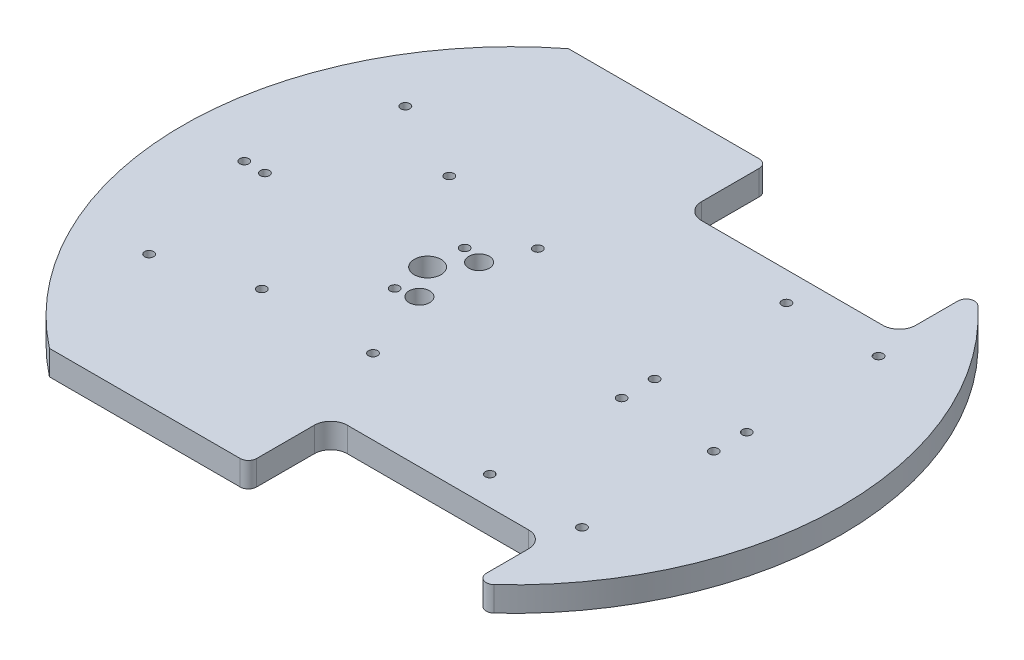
from build123d import *

# Parameters (mm, degrees)
ESQUISSE1_R      = 1.1
ESQUISSE1_R_2    = 2.5
ESQUISSE1_R_3    = 3.25
EXTRUSION1_DEPTH = 6


with BuildPart() as part:
    # Esquisse1 → Extrusion1 (new body)
    with BuildSketch(Plane(origin=(0, 0, 0), x_dir=(1, 0, 0), z_dir=(0, 1, 0))):
        with BuildLine():
            Line((-64.305172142, -63), (-18, -63))
            ThreePointArc((-18, -63), (-16.585786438, -62.414213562), (-16, -61))
            Line((-16, -61), (-16, -47))
            ThreePointArc((-16, -47), (-14.828427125, -44.171572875), (-12, -43))
            Line((-12, -43), (32, -43))
            ThreePointArc((32, -43), (34.828427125, -44.171572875), (36, -47))
            Line((36, -47), (36, -57.227615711))
            ThreePointArc((36, -57.227615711), (37.199359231, -59.060366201), (39.358974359, -58.694990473))
            ThreePointArc((39.358974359, -58.694990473), (65, 0), (39.358974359, 58.694990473))
            ThreePointArc((39.358974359, 58.694990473), (37.199359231, 59.060366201), (36, 57.227615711))
            Line((36, 57.227615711), (36, 47))
            ThreePointArc((36, 47), (34.828427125, 44.171572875), (32, 43))
            Line((32, 43), (-12, 43))
            ThreePointArc((-12, 43), (-14.828427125, 44.171572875), (-16, 47))
            Line((-16, 47), (-16, 61))
            ThreePointArc((-16, 61), (-16.585786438, 62.414213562), (-18, 63))
            Line((-18, 63), (-64.305172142, 63))
            ThreePointArc((-64.305172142, 63), (-95, 0), (-64.305172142, -63))
        make_face()
        with Locations(Location((15.6, -4, 0), (0, 0, 270))):
            Circle(ESQUISSE1_R, mode=Mode.SUBTRACT)
        with Locations(Location((37.959035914, -4, 0), (0, 0, 270))):
            Circle(ESQUISSE1_R, mode=Mode.SUBTRACT)
        with Locations(Location((37.959035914, -36, 0), (0, 0, 90))):
            Circle(ESQUISSE1_R, mode=Mode.SUBTRACT)
        with Locations(Location((15.6, -36, 0), (0, 0, 90))):
            Circle(ESQUISSE1_R, mode=Mode.SUBTRACT)
        with Locations(Location((37.959035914, 4, 0), (0, 0, 90))):
            Circle(ESQUISSE1_R, mode=Mode.SUBTRACT)
        with Locations(Location((37.959035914, 36, 0), (0, 0, 270))):
            Circle(ESQUISSE1_R, mode=Mode.SUBTRACT)
        with Locations(Location((15.6, 36, 0), (0, 0, 270))):
            Circle(ESQUISSE1_R, mode=Mode.SUBTRACT)
        with Locations(Location((15.6, 4, 0), (0, 0, 90))):
            Circle(ESQUISSE1_R, mode=Mode.SUBTRACT)
        with Locations(Location((-35, -8.5, 0), (0, 0, 90))):
            Circle(ESQUISSE1_R, mode=Mode.SUBTRACT)
        with Locations(Location((-30.25, 7.25, 0), (0, 0, 90))):
            Circle(ESQUISSE1_R_2, mode=Mode.SUBTRACT)
        with Locations(Location((-72, -31.1, 0), (0, 0, 90))):
            Circle(ESQUISSE1_R, mode=Mode.SUBTRACT)
        with Locations(Location((-72, 31.1, 0), (0, 0, 270))):
            Circle(ESQUISSE1_R, mode=Mode.SUBTRACT)
        with Locations(Location((-80, 0, 0), (0, 0, 270))):
            Circle(ESQUISSE1_R, mode=Mode.SUBTRACT)
        with Locations(Location((-35, 8.5, 0), (0, 0, 270))):
            Circle(ESQUISSE1_R, mode=Mode.SUBTRACT)
        with Locations(Location((-35.5, 0, 0), (0, 0, 270))):
            Circle(ESQUISSE1_R_3, mode=Mode.SUBTRACT)
        with Locations(Location((-30.25, -7.25, 0), (0, 0, 270))):
            Circle(ESQUISSE1_R_2, mode=Mode.SUBTRACT)
        with Locations(Location((-51, -24.75, 0), (0, 0, 270))):
            Circle(ESQUISSE1_R, mode=Mode.SUBTRACT)
        with Locations(Location((-24, -24.75, 0), (0, 0, 90))):
            Circle(ESQUISSE1_R, mode=Mode.SUBTRACT)
        with Locations(Location((-26, 17.25, 0), (0, 0, 270))):
            Circle(ESQUISSE1_R, mode=Mode.SUBTRACT)
        with Locations(Location((-52, 21.75, 0), (0, 0, 270))):
            Circle(ESQUISSE1_R, mode=Mode.SUBTRACT)
        with Locations(Location((-75, 0, 0), (0, 0, 270))):
            Circle(ESQUISSE1_R, mode=Mode.SUBTRACT)
    extrude(amount=EXTRUSION1_DEPTH)


solid = part.part
